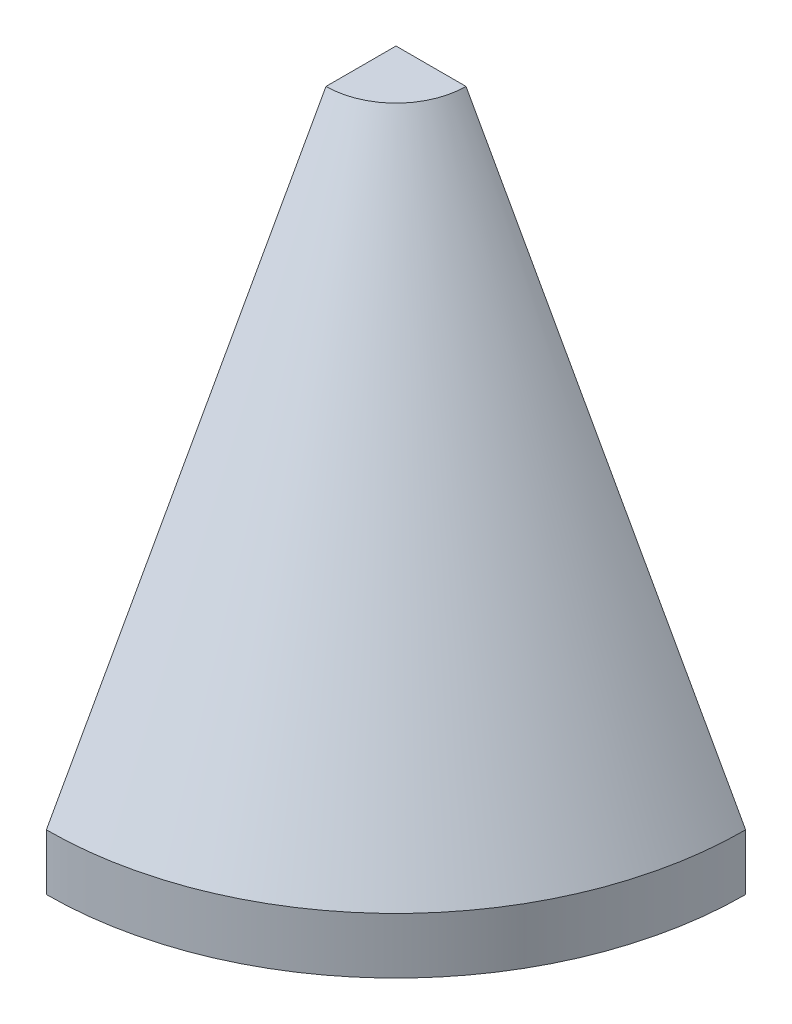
ISO-10303-21;
HEADER;
FILE_DESCRIPTION(('STEP AP214'),'2;1');
FILE_NAME('part.step','',(''),(''),'','','');
FILE_SCHEMA(('AUTOMOTIVE_DESIGN { 1 0 10303 214 1 1 1 1 }'));
ENDSEC;
DATA;
#1=APPLICATION_CONTEXT('core data for automotive mechanical design processes');
#2=APPLICATION_PROTOCOL_DEFINITION('international standard','automotive_design',2000,#1);
#3=PRODUCT_CONTEXT('',#1,'mechanical');
#4=PRODUCT('Part','Part','',(#3));
#5=PRODUCT_RELATED_PRODUCT_CATEGORY('part','',(#4));
#6=PRODUCT_DEFINITION_FORMATION('','',#4);
#7=PRODUCT_DEFINITION_CONTEXT('part definition',#1,'design');
#8=PRODUCT_DEFINITION('design','',#6,#7);
#9=PRODUCT_DEFINITION_SHAPE('','',#8);
#10=(LENGTH_UNIT() NAMED_UNIT(*) SI_UNIT(.MILLI.,.METRE.));
#11=(NAMED_UNIT(*) PLANE_ANGLE_UNIT() SI_UNIT($,.RADIAN.));
#12=(NAMED_UNIT(*) SI_UNIT($,.STERADIAN.) SOLID_ANGLE_UNIT());
#13=UNCERTAINTY_MEASURE_WITH_UNIT(LENGTH_MEASURE(1.E-05),#10,'distance_accuracy_value','');
#14=(GEOMETRIC_REPRESENTATION_CONTEXT(3) GLOBAL_UNCERTAINTY_ASSIGNED_CONTEXT((#13)) GLOBAL_UNIT_ASSIGNED_CONTEXT((#10,
#11,#12)) REPRESENTATION_CONTEXT('',''));
#15=CARTESIAN_POINT('',(0.,0.,0.));
#16=DIRECTION('',(0.,0.,1.));
#17=DIRECTION('',(1.,0.,0.));
#18=AXIS2_PLACEMENT_3D('',#15,#16,#17);
#19=CARTESIAN_POINT('',(0.,200.,0.));
#20=DIRECTION('',(0.,-1.,0.));
#21=DIRECTION('',(0.,0.,-1.));
#22=AXIS2_PLACEMENT_3D('',#19,#20,#21);
#23=PLANE('',#22);
#24=CARTESIAN_POINT('',(0.,200.,0.));
#25=DIRECTION('',(0.,1.,0.));
#26=DIRECTION('',(0.,0.,1.));
#27=AXIS2_PLACEMENT_3D('',#24,#25,#26);
#28=CIRCLE('',#27,25.);
#29=CARTESIAN_POINT('',(0.,200.,25.));
#30=VERTEX_POINT('',#29);
#31=CARTESIAN_POINT('',(25.,200.,0.));
#32=VERTEX_POINT('',#31);
#33=EDGE_CURVE('E11',#30,#32,#28,.T.);
#34=ORIENTED_EDGE('',*,*,#33,.T.);
#35=DIRECTION('',(-1.,0.,0.));
#36=VECTOR('',#35,1.);
#37=CARTESIAN_POINT('',(0.,200.,0.));
#38=LINE('',#37,#36);
#39=CARTESIAN_POINT('',(0.,200.,0.));
#40=VERTEX_POINT('',#39);
#41=EDGE_CURVE('E45',#32,#40,#38,.T.);
#42=ORIENTED_EDGE('',*,*,#41,.T.);
#43=DIRECTION('',(0.,0.,-1.));
#44=VECTOR('',#43,1.);
#45=CARTESIAN_POINT('',(0.,200.,0.));
#46=LINE('',#45,#44);
#47=EDGE_CURVE('E83',#30,#40,#46,.T.);
#48=ORIENTED_EDGE('',*,*,#47,.F.);
#49=EDGE_LOOP('',(#34,#42,#48));
#50=FACE_BOUND('',#49,.T.);
#51=ADVANCED_FACE('F32',(#50),#23,.F.);
#52=CARTESIAN_POINT('',(0.,20.,0.));
#53=DIRECTION('',(0.,-1.,0.));
#54=DIRECTION('',(0.,0.,-1.));
#55=AXIS2_PLACEMENT_3D('',#52,#53,#54);
#56=CONICAL_SURFACE('',#55,124.879785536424,0.506588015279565);
#57=CARTESIAN_POINT('',(0.,20.,0.));
#58=DIRECTION('',(0.,1.,0.));
#59=DIRECTION('',(0.,0.,1.));
#60=AXIS2_PLACEMENT_3D('',#57,#58,#59);
#61=CIRCLE('',#60,124.879785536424);
#62=CARTESIAN_POINT('',(-4.36015440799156E-13,20.,124.879785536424));
#63=VERTEX_POINT('',#62);
#64=CARTESIAN_POINT('',(124.879785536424,20.,0.));
#65=VERTEX_POINT('',#64);
#66=EDGE_CURVE('E39',#63,#65,#61,.T.);
#67=ORIENTED_EDGE('',*,*,#66,.T.);
#68=DIRECTION('',(-0.485196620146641,0.874405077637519,0.));
#69=VECTOR('',#68,1.);
#70=CARTESIAN_POINT('',(25.,200.,0.));
#71=LINE('',#70,#69);
#72=EDGE_CURVE('E93',#65,#32,#71,.T.);
#73=ORIENTED_EDGE('',*,*,#72,.T.);
#74=ORIENTED_EDGE('',*,*,#33,.F.);
#75=DIRECTION('',(0.,0.874405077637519,-0.485196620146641));
#76=VECTOR('',#75,1.);
#77=CARTESIAN_POINT('',(0.,200.,25.));
#78=LINE('',#77,#76);
#79=EDGE_CURVE('E102',#63,#30,#78,.T.);
#80=ORIENTED_EDGE('',*,*,#79,.F.);
#81=EDGE_LOOP('',(#67,#73,#74,#80));
#82=FACE_BOUND('',#81,.T.);
#83=ADVANCED_FACE('F104',(#82),#56,.T.);
#84=CARTESIAN_POINT('',(0.,0.,0.));
#85=DIRECTION('',(0.,1.,0.));
#86=DIRECTION('',(0.,0.,1.));
#87=AXIS2_PLACEMENT_3D('',#84,#85,#86);
#88=CYLINDRICAL_SURFACE('',#87,124.879785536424);
#89=CARTESIAN_POINT('',(0.,0.,0.));
#90=DIRECTION('',(0.,1.,0.));
#91=DIRECTION('',(0.,0.,1.));
#92=AXIS2_PLACEMENT_3D('',#89,#90,#91);
#93=CIRCLE('',#92,124.879785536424);
#94=CARTESIAN_POINT('',(-4.36015440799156E-13,0.,124.879785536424));
#95=VERTEX_POINT('',#94);
#96=CARTESIAN_POINT('',(124.879785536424,0.,0.));
#97=VERTEX_POINT('',#96);
#98=EDGE_CURVE('E72',#95,#97,#93,.T.);
#99=ORIENTED_EDGE('',*,*,#98,.T.);
#100=DIRECTION('',(0.,1.,0.));
#101=VECTOR('',#100,1.);
#102=CARTESIAN_POINT('',(124.879785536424,0.,0.));
#103=LINE('',#102,#101);
#104=EDGE_CURVE('E76',#97,#65,#103,.T.);
#105=ORIENTED_EDGE('',*,*,#104,.T.);
#106=ORIENTED_EDGE('',*,*,#66,.F.);
#107=DIRECTION('',(0.,1.,0.));
#108=VECTOR('',#107,1.);
#109=CARTESIAN_POINT('',(-4.36015440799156E-13,0.,124.879785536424));
#110=LINE('',#109,#108);
#111=EDGE_CURVE('E79',#95,#63,#110,.T.);
#112=ORIENTED_EDGE('',*,*,#111,.F.);
#113=EDGE_LOOP('',(#99,#105,#106,#112));
#114=FACE_BOUND('',#113,.T.);
#115=ADVANCED_FACE('F74',(#114),#88,.T.);
#116=CARTESIAN_POINT('',(0.,0.,0.));
#117=DIRECTION('',(0.,1.,0.));
#118=DIRECTION('',(0.,0.,1.));
#119=AXIS2_PLACEMENT_3D('',#116,#117,#118);
#120=PLANE('',#119);
#121=DIRECTION('',(0.,0.,1.));
#122=VECTOR('',#121,1.);
#123=CARTESIAN_POINT('',(0.,0.,0.));
#124=LINE('',#123,#122);
#125=CARTESIAN_POINT('',(0.,0.,0.));
#126=VERTEX_POINT('',#125);
#127=EDGE_CURVE('E88',#126,#95,#124,.T.);
#128=ORIENTED_EDGE('',*,*,#127,.F.);
#129=DIRECTION('',(1.,0.,0.));
#130=VECTOR('',#129,1.);
#131=CARTESIAN_POINT('',(0.,0.,0.));
#132=LINE('',#131,#130);
#133=EDGE_CURVE('E86',#126,#97,#132,.T.);
#134=ORIENTED_EDGE('',*,*,#133,.T.);
#135=ORIENTED_EDGE('',*,*,#98,.F.);
#136=EDGE_LOOP('',(#128,#134,#135));
#137=FACE_BOUND('',#136,.T.);
#138=ADVANCED_FACE('F87',(#137),#120,.F.);
#139=CARTESIAN_POINT('',(0.,0.,0.));
#140=DIRECTION('',(1.,0.,0.));
#141=DIRECTION('',(0.,0.,-1.));
#142=AXIS2_PLACEMENT_3D('',#139,#140,#141);
#143=PLANE('',#142);
#144=DIRECTION('',(0.,-1.,0.));
#145=VECTOR('',#144,1.);
#146=CARTESIAN_POINT('',(0.,0.,0.));
#147=LINE('',#146,#145);
#148=EDGE_CURVE('E98',#40,#126,#147,.T.);
#149=ORIENTED_EDGE('',*,*,#148,.T.);
#150=ORIENTED_EDGE('',*,*,#127,.T.);
#151=ORIENTED_EDGE('',*,*,#111,.T.);
#152=ORIENTED_EDGE('',*,*,#79,.T.);
#153=ORIENTED_EDGE('',*,*,#47,.T.);
#154=EDGE_LOOP('',(#149,#150,#151,#152,#153));
#155=FACE_BOUND('',#154,.T.);
#156=ADVANCED_FACE('F106',(#155),#143,.F.);
#157=CARTESIAN_POINT('',(0.,0.,0.));
#158=DIRECTION('',(0.,0.,-1.));
#159=DIRECTION('',(-1.,0.,0.));
#160=AXIS2_PLACEMENT_3D('',#157,#158,#159);
#161=PLANE('',#160);
#162=ORIENTED_EDGE('',*,*,#148,.F.);
#163=ORIENTED_EDGE('',*,*,#41,.F.);
#164=ORIENTED_EDGE('',*,*,#72,.F.);
#165=ORIENTED_EDGE('',*,*,#104,.F.);
#166=ORIENTED_EDGE('',*,*,#133,.F.);
#167=EDGE_LOOP('',(#162,#163,#164,#165,#166));
#168=FACE_BOUND('',#167,.T.);
#169=ADVANCED_FACE('F92',(#168),#161,.T.);
#170=CLOSED_SHELL('',(#51,#83,#115,#138,#156,#169));
#171=MANIFOLD_SOLID_BREP('B2',#170);
#172=ADVANCED_BREP_SHAPE_REPRESENTATION('',(#18,#171),#14);
#173=SHAPE_DEFINITION_REPRESENTATION(#9,#172);
ENDSEC;
END-ISO-10303-21;
